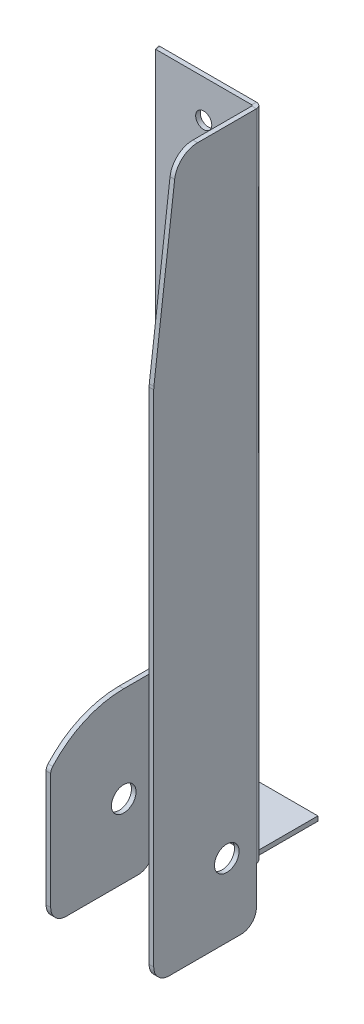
ISO-10303-21;
HEADER;
FILE_DESCRIPTION(('STEP AP214'),'2;1');
FILE_NAME('part.step','',(''),(''),'','','');
FILE_SCHEMA(('AUTOMOTIVE_DESIGN { 1 0 10303 214 1 1 1 1 }'));
ENDSEC;
DATA;
#1=APPLICATION_CONTEXT('core data for automotive mechanical design processes');
#2=APPLICATION_PROTOCOL_DEFINITION('international standard','automotive_design',2000,#1);
#3=PRODUCT_CONTEXT('',#1,'mechanical');
#4=PRODUCT('Part','Part','',(#3));
#5=PRODUCT_RELATED_PRODUCT_CATEGORY('part','',(#4));
#6=PRODUCT_DEFINITION_FORMATION('','',#4);
#7=PRODUCT_DEFINITION_CONTEXT('part definition',#1,'design');
#8=PRODUCT_DEFINITION('design','',#6,#7);
#9=PRODUCT_DEFINITION_SHAPE('','',#8);
#10=(LENGTH_UNIT() NAMED_UNIT(*) SI_UNIT(.MILLI.,.METRE.));
#11=(NAMED_UNIT(*) PLANE_ANGLE_UNIT() SI_UNIT($,.RADIAN.));
#12=(NAMED_UNIT(*) SI_UNIT($,.STERADIAN.) SOLID_ANGLE_UNIT());
#13=UNCERTAINTY_MEASURE_WITH_UNIT(LENGTH_MEASURE(1.E-05),#10,'distance_accuracy_value','');
#14=(GEOMETRIC_REPRESENTATION_CONTEXT(3) GLOBAL_UNCERTAINTY_ASSIGNED_CONTEXT((#13)) GLOBAL_UNIT_ASSIGNED_CONTEXT((#10,
#11,#12)) REPRESENTATION_CONTEXT('',''));
#15=CARTESIAN_POINT('',(0.,0.,0.));
#16=DIRECTION('',(0.,0.,1.));
#17=DIRECTION('',(1.,0.,0.));
#18=AXIS2_PLACEMENT_3D('',#15,#16,#17);
#19=CARTESIAN_POINT('',(35.0000000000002,425.,70.5));
#20=DIRECTION('',(0.,-1.,0.));
#21=DIRECTION('',(1.,0.,0.));
#22=AXIS2_PLACEMENT_3D('',#19,#20,#21);
#23=PLANE('',#22);
#24=DIRECTION('',(0.,0.,1.));
#25=VECTOR('',#24,1.);
#26=CARTESIAN_POINT('',(32.0000000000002,425.,70.5));
#27=LINE('',#26,#25);
#28=CARTESIAN_POINT('',(32.0000000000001,425.,3.73660000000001));
#29=VERTEX_POINT('',#28);
#30=CARTESIAN_POINT('',(32.0000000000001,425.,42.0038354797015));
#31=VERTEX_POINT('',#30);
#32=EDGE_CURVE('E336',#29,#31,#27,.T.);
#33=ORIENTED_EDGE('',*,*,#32,.T.);
#34=DIRECTION('',(-1.,0.,0.));
#35=VECTOR('',#34,1.);
#36=CARTESIAN_POINT('',(35.0000000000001,425.,42.0038354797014));
#37=LINE('',#36,#35);
#38=CARTESIAN_POINT('',(35.0000000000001,425.,42.0038354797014));
#39=VERTEX_POINT('',#38);
#40=EDGE_CURVE('E442',#31,#39,#37,.F.);
#41=ORIENTED_EDGE('',*,*,#40,.T.);
#42=DIRECTION('',(0.,0.,1.));
#43=VECTOR('',#42,1.);
#44=CARTESIAN_POINT('',(35.0000000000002,425.,70.5));
#45=LINE('',#44,#43);
#46=CARTESIAN_POINT('',(35.,425.,3.73660000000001));
#47=VERTEX_POINT('',#46);
#48=EDGE_CURVE('E341',#47,#39,#45,.T.);
#49=ORIENTED_EDGE('',*,*,#48,.F.);
#50=DIRECTION('',(1.,0.,0.));
#51=VECTOR('',#50,1.);
#52=CARTESIAN_POINT('',(32.,425.,3.73660000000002));
#53=LINE('',#52,#51);
#54=EDGE_CURVE('E328',#29,#47,#53,.T.);
#55=ORIENTED_EDGE('',*,*,#54,.F.);
#56=EDGE_LOOP('',(#33,#41,#49,#55));
#57=FACE_BOUND('',#56,.T.);
#58=ADVANCED_FACE('F52',(#57),#23,.F.);
#59=CARTESIAN_POINT('',(35.0000000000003,0.,70.5));
#60=DIRECTION('',(-1.,0.,0.));
#61=DIRECTION('',(0.,0.,1.));
#62=AXIS2_PLACEMENT_3D('',#59,#60,#61);
#63=PLANE('',#62);
#64=CARTESIAN_POINT('',(35.0000000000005,12.5,23.0000000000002));
#65=DIRECTION('',(-1.,0.,0.));
#66=DIRECTION('',(0.,0.,1.));
#67=AXIS2_PLACEMENT_3D('',#64,#65,#66);
#68=CIRCLE('',#67,8.);
#69=CARTESIAN_POINT('',(35.0000000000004,12.5,31.0000000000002));
#70=VERTEX_POINT('',#69);
#71=EDGE_CURVE('E388',#70,#70,#68,.T.);
#72=ORIENTED_EDGE('',*,*,#71,.T.);
#73=EDGE_LOOP('',(#72));
#74=FACE_BOUND('',#73,.T.);
#75=DIRECTION('',(0.,0.992546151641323,-0.121869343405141));
#76=VECTOR('',#75,1.);
#77=CARTESIAN_POINT('',(35.0000000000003,301.,70.5));
#78=LINE('',#77,#76);
#79=CARTESIAN_POINT('',(35.0000000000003,301.91060084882,70.3881922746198));
#80=VERTEX_POINT('',#79);
#81=CARTESIAN_POINT('',(35.0000000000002,411.828040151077,56.8920277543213));
#82=VERTEX_POINT('',#81);
#83=EDGE_CURVE('E734',#80,#82,#78,.T.);
#84=ORIENTED_EDGE('',*,*,#83,.F.);
#85=CARTESIAN_POINT('',(35.0000000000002,300.082560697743,55.5));
#86=DIRECTION('',(-1.,0.,0.));
#87=DIRECTION('',(0.,0.,1.));
#88=AXIS2_PLACEMENT_3D('',#85,#86,#87);
#89=CIRCLE('',#88,15.);
#90=CARTESIAN_POINT('',(35.0000000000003,300.082560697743,70.5));
#91=VERTEX_POINT('',#90);
#92=EDGE_CURVE('E440',#80,#91,#89,.F.);
#93=ORIENTED_EDGE('',*,*,#92,.T.);
#94=DIRECTION('',(0.,-1.,0.));
#95=VECTOR('',#94,1.);
#96=CARTESIAN_POINT('',(35.0000000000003,0.,70.5));
#97=LINE('',#96,#95);
#98=CARTESIAN_POINT('',(35.0000000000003,-25.,70.5));
#99=VERTEX_POINT('',#98);
#100=EDGE_CURVE('E344',#91,#99,#97,.T.);
#101=ORIENTED_EDGE('',*,*,#100,.T.);
#102=CARTESIAN_POINT('',(35.0000000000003,-25.,60.5));
#103=DIRECTION('',(-1.,0.,0.));
#104=DIRECTION('',(0.,0.,1.));
#105=AXIS2_PLACEMENT_3D('',#102,#103,#104);
#106=CIRCLE('',#105,10.);
#107=CARTESIAN_POINT('',(35.0000000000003,-35.,60.5));
#108=VERTEX_POINT('',#107);
#109=EDGE_CURVE('E410',#99,#108,#106,.F.);
#110=ORIENTED_EDGE('',*,*,#109,.T.);
#111=DIRECTION('',(0.,0.,1.));
#112=VECTOR('',#111,1.);
#113=CARTESIAN_POINT('',(35.0000000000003,-35.,3.73660000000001));
#114=LINE('',#113,#112);
#115=CARTESIAN_POINT('',(35.0000000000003,-35.,13.7366));
#116=VERTEX_POINT('',#115);
#117=EDGE_CURVE('E745',#116,#108,#114,.T.);
#118=ORIENTED_EDGE('',*,*,#117,.F.);
#119=CARTESIAN_POINT('',(35.0000000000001,-25.,13.7366));
#120=DIRECTION('',(-1.,0.,0.));
#121=DIRECTION('',(0.,0.,1.));
#122=AXIS2_PLACEMENT_3D('',#119,#120,#121);
#123=CIRCLE('',#122,10.);
#124=CARTESIAN_POINT('',(35.0000000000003,-25.,3.73660000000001));
#125=VERTEX_POINT('',#124);
#126=EDGE_CURVE('E412',#116,#125,#123,.F.);
#127=ORIENTED_EDGE('',*,*,#126,.T.);
#128=DIRECTION('',(0.,1.,0.));
#129=VECTOR('',#128,1.);
#130=CARTESIAN_POINT('',(35.0000000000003,-35.,3.73660000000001));
#131=LINE('',#130,#129);
#132=CARTESIAN_POINT('',(35.0000000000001,0.,3.7366));
#133=VERTEX_POINT('',#132);
#134=EDGE_CURVE('E748',#125,#133,#131,.T.);
#135=ORIENTED_EDGE('',*,*,#134,.T.);
#136=DIRECTION('',(0.,-1.,0.));
#137=VECTOR('',#136,1.);
#138=CARTESIAN_POINT('',(35.0000000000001,0.,3.73659999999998));
#139=LINE('',#138,#137);
#140=EDGE_CURVE('E331',#47,#133,#139,.T.);
#141=ORIENTED_EDGE('',*,*,#140,.F.);
#142=ORIENTED_EDGE('',*,*,#48,.T.);
#143=CARTESIAN_POINT('',(35.0000000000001,410.,42.0038354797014));
#144=DIRECTION('',(-1.,0.,0.));
#145=DIRECTION('',(0.,0.,1.));
#146=AXIS2_PLACEMENT_3D('',#143,#144,#145);
#147=CIRCLE('',#146,15.);
#148=EDGE_CURVE('E438',#39,#82,#147,.F.);
#149=ORIENTED_EDGE('',*,*,#148,.T.);
#150=EDGE_LOOP('',(#84,#93,#101,#110,#118,#127,#135,#141,#142,#149));
#151=FACE_BOUND('',#150,.T.);
#152=ADVANCED_FACE('F582',(#74,#151),#63,.F.);
#153=CARTESIAN_POINT('',(32.0000000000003,0.,70.5));
#154=DIRECTION('',(-1.,0.,0.));
#155=DIRECTION('',(0.,0.,1.));
#156=AXIS2_PLACEMENT_3D('',#153,#154,#155);
#157=PLANE('',#156);
#158=CARTESIAN_POINT('',(32.0000000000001,12.5,23.0000000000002));
#159=DIRECTION('',(-1.,0.,0.));
#160=DIRECTION('',(0.,0.,1.));
#161=AXIS2_PLACEMENT_3D('',#158,#159,#160);
#162=CIRCLE('',#161,8.);
#163=CARTESIAN_POINT('',(32.0000000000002,12.5,31.0000000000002));
#164=VERTEX_POINT('',#163);
#165=EDGE_CURVE('E387',#164,#164,#162,.T.);
#166=ORIENTED_EDGE('',*,*,#165,.F.);
#167=EDGE_LOOP('',(#166));
#168=FACE_BOUND('',#167,.T.);
#169=DIRECTION('',(0.,-1.,0.));
#170=VECTOR('',#169,1.);
#171=CARTESIAN_POINT('',(32.0000000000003,0.,70.5));
#172=LINE('',#171,#170);
#173=CARTESIAN_POINT('',(32.0000000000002,300.082560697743,70.5));
#174=VERTEX_POINT('',#173);
#175=CARTESIAN_POINT('',(32.0000000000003,-25.,70.5));
#176=VERTEX_POINT('',#175);
#177=EDGE_CURVE('E339',#174,#176,#172,.T.);
#178=ORIENTED_EDGE('',*,*,#177,.F.);
#179=CARTESIAN_POINT('',(32.0000000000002,300.082560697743,55.5));
#180=DIRECTION('',(-1.,0.,0.));
#181=DIRECTION('',(0.,0.,1.));
#182=AXIS2_PLACEMENT_3D('',#179,#180,#181);
#183=CIRCLE('',#182,15.);
#184=CARTESIAN_POINT('',(32.0000000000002,301.91060084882,70.3881922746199));
#185=VERTEX_POINT('',#184);
#186=EDGE_CURVE('E431',#174,#185,#183,.T.);
#187=ORIENTED_EDGE('',*,*,#186,.T.);
#188=DIRECTION('',(0.,0.992546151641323,-0.121869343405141));
#189=VECTOR('',#188,1.);
#190=CARTESIAN_POINT('',(32.0000000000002,301.,70.5));
#191=LINE('',#190,#189);
#192=CARTESIAN_POINT('',(32.0000000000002,411.828040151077,56.8920277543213));
#193=VERTEX_POINT('',#192);
#194=EDGE_CURVE('E736',#185,#193,#191,.T.);
#195=ORIENTED_EDGE('',*,*,#194,.T.);
#196=CARTESIAN_POINT('',(32.0000000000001,410.,42.0038354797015));
#197=DIRECTION('',(-1.,0.,0.));
#198=DIRECTION('',(0.,0.,1.));
#199=AXIS2_PLACEMENT_3D('',#196,#197,#198);
#200=CIRCLE('',#199,15.);
#201=EDGE_CURVE('E429',#193,#31,#200,.T.);
#202=ORIENTED_EDGE('',*,*,#201,.T.);
#203=ORIENTED_EDGE('',*,*,#32,.F.);
#204=DIRECTION('',(0.,1.,0.));
#205=VECTOR('',#204,1.);
#206=CARTESIAN_POINT('',(32.0000000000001,0.,3.7366));
#207=LINE('',#206,#205);
#208=CARTESIAN_POINT('',(32.0000000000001,0.,3.73660000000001));
#209=VERTEX_POINT('',#208);
#210=EDGE_CURVE('E326',#209,#29,#207,.T.);
#211=ORIENTED_EDGE('',*,*,#210,.F.);
#212=DIRECTION('',(0.,1.,0.));
#213=VECTOR('',#212,1.);
#214=CARTESIAN_POINT('',(32.,-35.,3.73660000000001));
#215=LINE('',#214,#213);
#216=CARTESIAN_POINT('',(32.,-25.,3.73660000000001));
#217=VERTEX_POINT('',#216);
#218=EDGE_CURVE('E750',#217,#209,#215,.T.);
#219=ORIENTED_EDGE('',*,*,#218,.F.);
#220=CARTESIAN_POINT('',(32.0000000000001,-25.,13.7366));
#221=DIRECTION('',(-1.,0.,0.));
#222=DIRECTION('',(0.,0.,1.));
#223=AXIS2_PLACEMENT_3D('',#220,#221,#222);
#224=CIRCLE('',#223,10.);
#225=CARTESIAN_POINT('',(32.,-35.,13.7366));
#226=VERTEX_POINT('',#225);
#227=EDGE_CURVE('E419',#217,#226,#224,.T.);
#228=ORIENTED_EDGE('',*,*,#227,.T.);
#229=DIRECTION('',(0.,0.,-1.));
#230=VECTOR('',#229,1.);
#231=CARTESIAN_POINT('',(32.,-35.,3.73660000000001));
#232=LINE('',#231,#230);
#233=CARTESIAN_POINT('',(32.,-35.,60.5));
#234=VERTEX_POINT('',#233);
#235=EDGE_CURVE('E740',#234,#226,#232,.T.);
#236=ORIENTED_EDGE('',*,*,#235,.F.);
#237=CARTESIAN_POINT('',(32.0000000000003,-25.,60.5));
#238=DIRECTION('',(-1.,0.,0.));
#239=DIRECTION('',(0.,0.,1.));
#240=AXIS2_PLACEMENT_3D('',#237,#238,#239);
#241=CIRCLE('',#240,10.);
#242=EDGE_CURVE('E416',#234,#176,#241,.T.);
#243=ORIENTED_EDGE('',*,*,#242,.T.);
#244=EDGE_LOOP('',(#178,#187,#195,#202,#203,#211,#219,#228,#236,#243));
#245=FACE_BOUND('',#244,.T.);
#246=ADVANCED_FACE('F588',(#168,#245),#157,.T.);
#247=CARTESIAN_POINT('',(35.0000000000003,0.,70.5));
#248=DIRECTION('',(0.,0.,-1.));
#249=DIRECTION('',(-1.,0.,0.));
#250=AXIS2_PLACEMENT_3D('',#247,#248,#249);
#251=PLANE('',#250);
#252=ORIENTED_EDGE('',*,*,#100,.F.);
#253=DIRECTION('',(-1.,0.,0.));
#254=VECTOR('',#253,1.);
#255=CARTESIAN_POINT('',(32.0000000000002,300.082560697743,70.5));
#256=LINE('',#255,#254);
#257=EDGE_CURVE('E426',#91,#174,#256,.T.);
#258=ORIENTED_EDGE('',*,*,#257,.T.);
#259=ORIENTED_EDGE('',*,*,#177,.T.);
#260=DIRECTION('',(-1.,0.,0.));
#261=VECTOR('',#260,1.);
#262=CARTESIAN_POINT('',(35.0000000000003,-25.,70.5));
#263=LINE('',#262,#261);
#264=EDGE_CURVE('E421',#176,#99,#263,.F.);
#265=ORIENTED_EDGE('',*,*,#264,.T.);
#266=EDGE_LOOP('',(#252,#258,#259,#265));
#267=FACE_BOUND('',#266,.T.);
#268=ADVANCED_FACE('F593',(#267),#251,.F.);
#269=CARTESIAN_POINT('',(-31.2634,425.,3.7366));
#270=DIRECTION('',(0.,1.,0.));
#271=DIRECTION('',(0.,0.,1.));
#272=AXIS2_PLACEMENT_3D('',#269,#270,#271);
#273=PLANE('',#272);
#274=CARTESIAN_POINT('',(-31.2634,425.,3.7366));
#275=DIRECTION('',(0.,-1.,0.));
#276=DIRECTION('',(0.,0.,-1.));
#277=AXIS2_PLACEMENT_3D('',#274,#275,#276);
#278=CIRCLE('',#277,3.73659999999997);
#279=CARTESIAN_POINT('',(-31.2634000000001,425.,0.));
#280=VERTEX_POINT('',#279);
#281=CARTESIAN_POINT('',(-32.,425.,0.0733227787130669));
#282=VERTEX_POINT('',#281);
#283=EDGE_CURVE('E316',#280,#282,#278,.F.);
#284=ORIENTED_EDGE('',*,*,#283,.T.);
#285=DIRECTION('',(-0.197131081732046,0.,-0.980377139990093));
#286=VECTOR('',#285,1.);
#287=CARTESIAN_POINT('',(-32.,425.,0.0733227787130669));
#288=LINE('',#287,#286);
#289=CARTESIAN_POINT('',(-31.4086067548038,425.,3.01445419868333));
#290=VERTEX_POINT('',#289);
#291=EDGE_CURVE('E551',#282,#290,#288,.F.);
#292=ORIENTED_EDGE('',*,*,#291,.T.);
#293=CARTESIAN_POINT('',(-31.2634,425.,3.7366));
#294=DIRECTION('',(0.,-1.,0.));
#295=DIRECTION('',(0.,0.,-1.));
#296=AXIS2_PLACEMENT_3D('',#293,#294,#295);
#297=CIRCLE('',#296,0.736599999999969);
#298=CARTESIAN_POINT('',(-31.2634000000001,425.,3.));
#299=VERTEX_POINT('',#298);
#300=EDGE_CURVE('E289',#299,#290,#297,.F.);
#301=ORIENTED_EDGE('',*,*,#300,.F.);
#302=DIRECTION('',(0.,0.,-1.));
#303=VECTOR('',#302,1.);
#304=CARTESIAN_POINT('',(-31.2634000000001,425.,3.00000000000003));
#305=LINE('',#304,#303);
#306=EDGE_CURVE('E321',#299,#280,#305,.T.);
#307=ORIENTED_EDGE('',*,*,#306,.T.);
#308=EDGE_LOOP('',(#284,#292,#301,#307));
#309=FACE_BOUND('',#308,.T.);
#310=ADVANCED_FACE('F564',(#309),#273,.T.);
#311=CARTESIAN_POINT('',(-31.2634,0.,3.7366));
#312=DIRECTION('',(0.,-1.,0.));
#313=DIRECTION('',(-1.,0.,0.));
#314=AXIS2_PLACEMENT_3D('',#311,#312,#313);
#315=CYLINDRICAL_SURFACE('',#314,3.73659999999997);
#316=CARTESIAN_POINT('',(-31.2634,74.5,3.7366));
#317=DIRECTION('',(0.,-1.,0.));
#318=DIRECTION('',(1.,0.,0.));
#319=AXIS2_PLACEMENT_3D('',#316,#317,#318);
#320=CIRCLE('',#319,3.73659999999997);
#321=CARTESIAN_POINT('',(-32.,74.5,0.0733227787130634));
#322=VERTEX_POINT('',#321);
#323=CARTESIAN_POINT('',(-35.,74.5,3.73659999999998));
#324=VERTEX_POINT('',#323);
#325=EDGE_CURVE('E545',#322,#324,#320,.F.);
#326=ORIENTED_EDGE('',*,*,#325,.F.);
#327=DIRECTION('',(0.,-1.,0.));
#328=VECTOR('',#327,1.);
#329=CARTESIAN_POINT('',(-32.,0.,0.0733227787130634));
#330=LINE('',#329,#328);
#331=EDGE_CURVE('E273',#282,#322,#330,.T.);
#332=ORIENTED_EDGE('',*,*,#331,.F.);
#333=ORIENTED_EDGE('',*,*,#283,.F.);
#334=DIRECTION('',(0.,-1.,0.));
#335=VECTOR('',#334,1.);
#336=CARTESIAN_POINT('',(-31.2634000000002,0.,0.));
#337=LINE('',#336,#335);
#338=CARTESIAN_POINT('',(-31.2634000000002,3.7366,0.));
#339=VERTEX_POINT('',#338);
#340=EDGE_CURVE('E288',#339,#280,#337,.F.);
#341=ORIENTED_EDGE('',*,*,#340,.F.);
#342=CARTESIAN_POINT('',(-31.2634000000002,0.0733227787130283,0.));
#343=VERTEX_POINT('',#342);
#344=EDGE_CURVE('E317',#343,#339,#337,.F.);
#345=ORIENTED_EDGE('',*,*,#344,.F.);
#346=CARTESIAN_POINT('',(-31.2634000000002,0.,0.));
#347=VERTEX_POINT('',#346);
#348=EDGE_CURVE('E285',#347,#343,#337,.F.);
#349=ORIENTED_EDGE('',*,*,#348,.F.);
#350=CARTESIAN_POINT('',(-31.2634,0.,3.7366));
#351=DIRECTION('',(0.,-1.,0.));
#352=DIRECTION('',(0.,0.,-1.));
#353=AXIS2_PLACEMENT_3D('',#350,#351,#352);
#354=CIRCLE('',#353,3.73659999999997);
#355=CARTESIAN_POINT('',(-35.,0.,3.73659999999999));
#356=VERTEX_POINT('',#355);
#357=EDGE_CURVE('E280',#356,#347,#354,.T.);
#358=ORIENTED_EDGE('',*,*,#357,.F.);
#359=DIRECTION('',(0.,1.,0.));
#360=VECTOR('',#359,1.);
#361=CARTESIAN_POINT('',(-35.,425.,3.73659999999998));
#362=LINE('',#361,#360);
#363=EDGE_CURVE('E283',#356,#324,#362,.T.);
#364=ORIENTED_EDGE('',*,*,#363,.T.);
#365=EDGE_LOOP('',(#326,#332,#333,#341,#345,#349,#358,#364));
#366=FACE_BOUND('',#365,.T.);
#367=ADVANCED_FACE('F282',(#366),#315,.T.);
#368=CARTESIAN_POINT('',(-31.2634,0.,3.7366));
#369=DIRECTION('',(0.,-1.,0.));
#370=DIRECTION('',(-1.,0.,0.));
#371=AXIS2_PLACEMENT_3D('',#368,#369,#370);
#372=CYLINDRICAL_SURFACE('',#371,0.736599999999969);
#373=DIRECTION('',(0.,-1.,0.));
#374=VECTOR('',#373,1.);
#375=CARTESIAN_POINT('',(-31.4086067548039,0.,3.01445419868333));
#376=LINE('',#375,#374);
#377=CARTESIAN_POINT('',(-31.4086067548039,74.5,3.01445419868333));
#378=VERTEX_POINT('',#377);
#379=EDGE_CURVE('E547',#290,#378,#376,.T.);
#380=ORIENTED_EDGE('',*,*,#379,.T.);
#381=CARTESIAN_POINT('',(-31.2634,74.5,3.7366));
#382=DIRECTION('',(0.,-1.,0.));
#383=DIRECTION('',(0.,0.,-1.));
#384=AXIS2_PLACEMENT_3D('',#381,#382,#383);
#385=CIRCLE('',#384,0.736599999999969);
#386=CARTESIAN_POINT('',(-32.,74.5,3.73659999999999));
#387=VERTEX_POINT('',#386);
#388=EDGE_CURVE('E535',#378,#387,#385,.F.);
#389=ORIENTED_EDGE('',*,*,#388,.T.);
#390=DIRECTION('',(0.,-1.,0.));
#391=VECTOR('',#390,1.);
#392=CARTESIAN_POINT('',(-32.,425.,3.7366));
#393=LINE('',#392,#391);
#394=CARTESIAN_POINT('',(-32.0000000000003,0.,3.73659999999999));
#395=VERTEX_POINT('',#394);
#396=EDGE_CURVE('E295',#387,#395,#393,.T.);
#397=ORIENTED_EDGE('',*,*,#396,.T.);
#398=CARTESIAN_POINT('',(-31.2634,0.,3.7366));
#399=DIRECTION('',(0.,-1.,0.));
#400=DIRECTION('',(0.,0.,-1.));
#401=AXIS2_PLACEMENT_3D('',#398,#399,#400);
#402=CIRCLE('',#401,0.736599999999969);
#403=CARTESIAN_POINT('',(-31.2634000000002,0.,3.00000000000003));
#404=VERTEX_POINT('',#403);
#405=EDGE_CURVE('E294',#395,#404,#402,.T.);
#406=ORIENTED_EDGE('',*,*,#405,.T.);
#407=DIRECTION('',(0.,-1.,0.));
#408=VECTOR('',#407,1.);
#409=CARTESIAN_POINT('',(-31.2634000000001,0.,3.00000000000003));
#410=LINE('',#409,#408);
#411=CARTESIAN_POINT('',(-31.2634000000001,3.7366,3.00000000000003));
#412=VERTEX_POINT('',#411);
#413=EDGE_CURVE('E310',#404,#412,#410,.F.);
#414=ORIENTED_EDGE('',*,*,#413,.T.);
#415=EDGE_CURVE('E313',#412,#299,#410,.F.);
#416=ORIENTED_EDGE('',*,*,#415,.T.);
#417=ORIENTED_EDGE('',*,*,#300,.T.);
#418=EDGE_LOOP('',(#380,#389,#397,#406,#414,#416,#417));
#419=FACE_BOUND('',#418,.T.);
#420=ADVANCED_FACE('F534',(#419),#372,.F.);
#421=CARTESIAN_POINT('',(-35.0000000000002,425.,70.5));
#422=DIRECTION('',(1.,0.,0.));
#423=DIRECTION('',(0.,0.,-1.));
#424=AXIS2_PLACEMENT_3D('',#421,#422,#423);
#425=PLANE('',#424);
#426=CARTESIAN_POINT('',(-35.0000000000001,12.5,23.));
#427=DIRECTION('',(-1.,0.,0.));
#428=DIRECTION('',(0.,0.,1.));
#429=AXIS2_PLACEMENT_3D('',#426,#427,#428);
#430=CIRCLE('',#429,8.);
#431=CARTESIAN_POINT('',(-35.0000000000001,12.5,31.));
#432=VERTEX_POINT('',#431);
#433=EDGE_CURVE('E471',#432,#432,#430,.T.);
#434=ORIENTED_EDGE('',*,*,#433,.F.);
#435=EDGE_LOOP('',(#434));
#436=FACE_BOUND('',#435,.T.);
#437=DIRECTION('',(0.,1.,0.));
#438=VECTOR('',#437,1.);
#439=CARTESIAN_POINT('',(-35.0000000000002,425.,70.5));
#440=LINE('',#439,#438);
#441=CARTESIAN_POINT('',(-35.0000000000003,-25.,70.5));
#442=VERTEX_POINT('',#441);
#443=CARTESIAN_POINT('',(-35.0000000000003,50.4835490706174,70.5));
#444=VERTEX_POINT('',#443);
#445=EDGE_CURVE('E303',#442,#444,#440,.T.);
#446=ORIENTED_EDGE('',*,*,#445,.T.);
#447=CARTESIAN_POINT('',(-35.0000000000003,50.4835490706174,65.5));
#448=DIRECTION('',(1.,0.,0.));
#449=DIRECTION('',(0.,0.,-1.));
#450=AXIS2_PLACEMENT_3D('',#447,#448,#449);
#451=CIRCLE('',#450,5.);
#452=CARTESIAN_POINT('',(-35.0000000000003,53.8154393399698,69.2280701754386));
#453=VERTEX_POINT('',#452);
#454=EDGE_CURVE('E13',#444,#453,#451,.F.);
#455=ORIENTED_EDGE('',*,*,#454,.T.);
#456=CARTESIAN_POINT('',(-35.0000000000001,12.5,23.));
#457=DIRECTION('',(1.,0.,0.));
#458=DIRECTION('',(0.,0.,-1.));
#459=AXIS2_PLACEMENT_3D('',#456,#457,#458);
#460=CIRCLE('',#459,62.);
#461=CARTESIAN_POINT('',(-35.0000000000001,74.5,23.));
#462=VERTEX_POINT('',#461);
#463=EDGE_CURVE('E454',#462,#453,#460,.T.);
#464=ORIENTED_EDGE('',*,*,#463,.F.);
#465=DIRECTION('',(0.,0.,1.));
#466=VECTOR('',#465,1.);
#467=CARTESIAN_POINT('',(-35.,74.5,0.));
#468=LINE('',#467,#466);
#469=EDGE_CURVE('E300',#324,#462,#468,.T.);
#470=ORIENTED_EDGE('',*,*,#469,.F.);
#471=ORIENTED_EDGE('',*,*,#363,.F.);
#472=DIRECTION('',(0.,1.,0.));
#473=VECTOR('',#472,1.);
#474=CARTESIAN_POINT('',(-35.,-35.,3.73659999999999));
#475=LINE('',#474,#473);
#476=CARTESIAN_POINT('',(-35.,-25.,3.73659999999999));
#477=VERTEX_POINT('',#476);
#478=EDGE_CURVE('E261',#477,#356,#475,.T.);
#479=ORIENTED_EDGE('',*,*,#478,.F.);
#480=CARTESIAN_POINT('',(-35.0000000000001,-25.,13.7366));
#481=DIRECTION('',(1.,0.,0.));
#482=DIRECTION('',(0.,0.,-1.));
#483=AXIS2_PLACEMENT_3D('',#480,#481,#482);
#484=CIRCLE('',#483,10.);
#485=CARTESIAN_POINT('',(-35.,-35.,13.7366));
#486=VERTEX_POINT('',#485);
#487=EDGE_CURVE('E402',#477,#486,#484,.F.);
#488=ORIENTED_EDGE('',*,*,#487,.T.);
#489=DIRECTION('',(0.,0.,-1.));
#490=VECTOR('',#489,1.);
#491=CARTESIAN_POINT('',(-35.,-35.,3.73659999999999));
#492=LINE('',#491,#490);
#493=CARTESIAN_POINT('',(-35.,-35.,60.5));
#494=VERTEX_POINT('',#493);
#495=EDGE_CURVE('E540',#494,#486,#492,.T.);
#496=ORIENTED_EDGE('',*,*,#495,.F.);
#497=CARTESIAN_POINT('',(-35.0000000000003,-25.,60.5));
#498=DIRECTION('',(1.,0.,0.));
#499=DIRECTION('',(0.,0.,-1.));
#500=AXIS2_PLACEMENT_3D('',#497,#498,#499);
#501=CIRCLE('',#500,10.);
#502=EDGE_CURVE('E400',#494,#442,#501,.F.);
#503=ORIENTED_EDGE('',*,*,#502,.T.);
#504=EDGE_LOOP('',(#446,#455,#464,#470,#471,#479,#488,#496,#503));
#505=FACE_BOUND('',#504,.T.);
#506=ADVANCED_FACE('F298',(#436,#505),#425,.F.);
#507=CARTESIAN_POINT('',(-32.0000000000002,425.,70.5));
#508=DIRECTION('',(1.,0.,0.));
#509=DIRECTION('',(0.,0.,-1.));
#510=AXIS2_PLACEMENT_3D('',#507,#508,#509);
#511=PLANE('',#510);
#512=CARTESIAN_POINT('',(-32.0000000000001,12.5,23.));
#513=DIRECTION('',(1.,0.,0.));
#514=DIRECTION('',(0.,0.,-1.));
#515=AXIS2_PLACEMENT_3D('',#512,#513,#514);
#516=CIRCLE('',#515,8.);
#517=CARTESIAN_POINT('',(-32.0000000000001,12.5,15.));
#518=VERTEX_POINT('',#517);
#519=EDGE_CURVE('E384',#518,#518,#516,.T.);
#520=ORIENTED_EDGE('',*,*,#519,.F.);
#521=EDGE_LOOP('',(#520));
#522=FACE_BOUND('',#521,.T.);
#523=CARTESIAN_POINT('',(-32.0000000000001,12.5,23.));
#524=DIRECTION('',(1.,0.,0.));
#525=DIRECTION('',(0.,0.,-1.));
#526=AXIS2_PLACEMENT_3D('',#523,#524,#525);
#527=CIRCLE('',#526,62.);
#528=CARTESIAN_POINT('',(-32.0000000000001,74.5,23.));
#529=VERTEX_POINT('',#528);
#530=CARTESIAN_POINT('',(-32.0000000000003,53.8154393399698,69.2280701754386));
#531=VERTEX_POINT('',#530);
#532=EDGE_CURVE('E452',#529,#531,#527,.T.);
#533=ORIENTED_EDGE('',*,*,#532,.T.);
#534=CARTESIAN_POINT('',(-32.0000000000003,50.4835490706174,65.5));
#535=DIRECTION('',(1.,0.,0.));
#536=DIRECTION('',(0.,0.,-1.));
#537=AXIS2_PLACEMENT_3D('',#534,#535,#536);
#538=CIRCLE('',#537,5.);
#539=CARTESIAN_POINT('',(-32.0000000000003,50.4835490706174,70.5));
#540=VERTEX_POINT('',#539);
#541=EDGE_CURVE('E74',#531,#540,#538,.T.);
#542=ORIENTED_EDGE('',*,*,#541,.T.);
#543=DIRECTION('',(0.,1.,0.));
#544=VECTOR('',#543,1.);
#545=CARTESIAN_POINT('',(-32.0000000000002,425.,70.5));
#546=LINE('',#545,#544);
#547=CARTESIAN_POINT('',(-32.0000000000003,-25.,70.5));
#548=VERTEX_POINT('',#547);
#549=EDGE_CURVE('E301',#548,#540,#546,.T.);
#550=ORIENTED_EDGE('',*,*,#549,.F.);
#551=CARTESIAN_POINT('',(-32.0000000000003,-25.,60.5));
#552=DIRECTION('',(1.,0.,0.));
#553=DIRECTION('',(0.,0.,-1.));
#554=AXIS2_PLACEMENT_3D('',#551,#552,#553);
#555=CIRCLE('',#554,10.);
#556=CARTESIAN_POINT('',(-32.0000000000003,-35.,60.5));
#557=VERTEX_POINT('',#556);
#558=EDGE_CURVE('E395',#548,#557,#555,.T.);
#559=ORIENTED_EDGE('',*,*,#558,.T.);
#560=DIRECTION('',(0.,0.,1.));
#561=VECTOR('',#560,1.);
#562=CARTESIAN_POINT('',(-32.0000000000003,-35.,3.73659999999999));
#563=LINE('',#562,#561);
#564=CARTESIAN_POINT('',(-32.0000000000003,-35.,13.7366));
#565=VERTEX_POINT('',#564);
#566=EDGE_CURVE('E537',#565,#557,#563,.T.);
#567=ORIENTED_EDGE('',*,*,#566,.F.);
#568=CARTESIAN_POINT('',(-32.0000000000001,-25.,13.7366));
#569=DIRECTION('',(1.,0.,0.));
#570=DIRECTION('',(0.,0.,-1.));
#571=AXIS2_PLACEMENT_3D('',#568,#569,#570);
#572=CIRCLE('',#571,10.);
#573=CARTESIAN_POINT('',(-32.0000000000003,-25.,3.73659999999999));
#574=VERTEX_POINT('',#573);
#575=EDGE_CURVE('E397',#565,#574,#572,.T.);
#576=ORIENTED_EDGE('',*,*,#575,.T.);
#577=DIRECTION('',(0.,1.,0.));
#578=VECTOR('',#577,1.);
#579=CARTESIAN_POINT('',(-32.0000000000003,-35.,3.73659999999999));
#580=LINE('',#579,#578);
#581=EDGE_CURVE('E274',#574,#395,#580,.T.);
#582=ORIENTED_EDGE('',*,*,#581,.T.);
#583=ORIENTED_EDGE('',*,*,#396,.F.);
#584=DIRECTION('',(0.,0.,-1.));
#585=VECTOR('',#584,1.);
#586=CARTESIAN_POINT('',(-32.0000000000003,74.5,70.5));
#587=LINE('',#586,#585);
#588=EDGE_CURVE('E460',#387,#529,#587,.F.);
#589=ORIENTED_EDGE('',*,*,#588,.T.);
#590=EDGE_LOOP('',(#533,#542,#550,#559,#567,#576,#582,#583,#589));
#591=FACE_BOUND('',#590,.T.);
#592=ADVANCED_FACE('F458',(#522,#591),#511,.T.);
#593=CARTESIAN_POINT('',(-35.0000000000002,425.,70.5));
#594=DIRECTION('',(0.,0.,-1.));
#595=DIRECTION('',(-1.,0.,0.));
#596=AXIS2_PLACEMENT_3D('',#593,#594,#595);
#597=PLANE('',#596);
#598=ORIENTED_EDGE('',*,*,#549,.T.);
#599=DIRECTION('',(-1.,0.,0.));
#600=VECTOR('',#599,1.);
#601=CARTESIAN_POINT('',(-35.0000000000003,50.4835490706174,70.5));
#602=LINE('',#601,#600);
#603=EDGE_CURVE('E60',#540,#444,#602,.T.);
#604=ORIENTED_EDGE('',*,*,#603,.T.);
#605=ORIENTED_EDGE('',*,*,#445,.F.);
#606=DIRECTION('',(-1.,0.,0.));
#607=VECTOR('',#606,1.);
#608=CARTESIAN_POINT('',(-35.0000000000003,-25.,70.5));
#609=LINE('',#608,#607);
#610=EDGE_CURVE('E424',#442,#548,#609,.F.);
#611=ORIENTED_EDGE('',*,*,#610,.T.);
#612=EDGE_LOOP('',(#598,#604,#605,#611));
#613=FACE_BOUND('',#612,.T.);
#614=ADVANCED_FACE('F694',(#613),#597,.F.);
#615=CARTESIAN_POINT('',(-31.2634000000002,0.,0.));
#616=DIRECTION('',(1.,0.,0.));
#617=DIRECTION('',(0.,1.,0.));
#618=AXIS2_PLACEMENT_3D('',#615,#616,#617);
#619=PLANE('',#618);
#620=ORIENTED_EDGE('',*,*,#348,.T.);
#621=CARTESIAN_POINT('',(-31.2634000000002,3.7366,-0.736599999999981));
#622=DIRECTION('',(-1.,0.,0.));
#623=DIRECTION('',(0.,0.,1.));
#624=AXIS2_PLACEMENT_3D('',#621,#622,#623);
#625=CIRCLE('',#624,3.7366);
#626=EDGE_CURVE('E383',#343,#412,#625,.T.);
#627=ORIENTED_EDGE('',*,*,#626,.T.);
#628=ORIENTED_EDGE('',*,*,#413,.F.);
#629=DIRECTION('',(0.,0.,-1.));
#630=VECTOR('',#629,1.);
#631=CARTESIAN_POINT('',(-31.2634000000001,0.,3.00000000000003));
#632=LINE('',#631,#630);
#633=EDGE_CURVE('E319',#404,#347,#632,.T.);
#634=ORIENTED_EDGE('',*,*,#633,.T.);
#635=EDGE_LOOP('',(#620,#627,#628,#634));
#636=FACE_BOUND('',#635,.T.);
#637=ADVANCED_FACE('F624',(#636),#619,.T.);
#638=CARTESIAN_POINT('',(31.2634,3.7366,0.));
#639=DIRECTION('',(-1.,0.,0.));
#640=DIRECTION('',(0.,0.,1.));
#641=AXIS2_PLACEMENT_3D('',#638,#639,#640);
#642=PLANE('',#641);
#643=DIRECTION('',(0.,1.,0.));
#644=VECTOR('',#643,1.);
#645=CARTESIAN_POINT('',(31.2634,425.,2.99999999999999));
#646=LINE('',#645,#644);
#647=CARTESIAN_POINT('',(31.2634,3.7366,2.99999999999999));
#648=VERTEX_POINT('',#647);
#649=CARTESIAN_POINT('',(31.2634,0.,2.99999999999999));
#650=VERTEX_POINT('',#649);
#651=EDGE_CURVE('E354',#648,#650,#646,.F.);
#652=ORIENTED_EDGE('',*,*,#651,.F.);
#653=CARTESIAN_POINT('',(31.2634,3.7366,-0.736600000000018));
#654=DIRECTION('',(-1.,0.,0.));
#655=DIRECTION('',(0.,0.,1.));
#656=AXIS2_PLACEMENT_3D('',#653,#654,#655);
#657=CIRCLE('',#656,3.7366);
#658=CARTESIAN_POINT('',(31.2634,0.0733227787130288,0.));
#659=VERTEX_POINT('',#658);
#660=EDGE_CURVE('E523',#648,#659,#657,.F.);
#661=ORIENTED_EDGE('',*,*,#660,.T.);
#662=DIRECTION('',(0.,-1.,0.));
#663=VECTOR('',#662,1.);
#664=CARTESIAN_POINT('',(31.2634,3.7366,0.));
#665=LINE('',#664,#663);
#666=CARTESIAN_POINT('',(31.2634,0.,0.));
#667=VERTEX_POINT('',#666);
#668=EDGE_CURVE('E526',#659,#667,#665,.T.);
#669=ORIENTED_EDGE('',*,*,#668,.T.);
#670=DIRECTION('',(0.,0.,-1.));
#671=VECTOR('',#670,1.);
#672=CARTESIAN_POINT('',(31.2634,0.,2.99999999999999));
#673=LINE('',#672,#671);
#674=EDGE_CURVE('E366',#650,#667,#673,.T.);
#675=ORIENTED_EDGE('',*,*,#674,.F.);
#676=EDGE_LOOP('',(#652,#661,#669,#675));
#677=FACE_BOUND('',#676,.T.);
#678=ADVANCED_FACE('F619',(#677),#642,.T.);
#679=CARTESIAN_POINT('',(-32.0000000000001,0.,3.));
#680=DIRECTION('',(0.,0.,1.));
#681=DIRECTION('',(1.,0.,0.));
#682=AXIS2_PLACEMENT_3D('',#679,#680,#681);
#683=PLANE('',#682);
#684=CARTESIAN_POINT('',(0.,400.6,3.));
#685=DIRECTION('',(0.,0.,1.));
#686=DIRECTION('',(1.,0.,0.));
#687=AXIS2_PLACEMENT_3D('',#684,#685,#686);
#688=CIRCLE('',#687,5.25);
#689=CARTESIAN_POINT('',(5.25,400.6,3.));
#690=VERTEX_POINT('',#689);
#691=EDGE_CURVE('E374',#690,#690,#688,.T.);
#692=ORIENTED_EDGE('',*,*,#691,.F.);
#693=EDGE_LOOP('',(#692));
#694=FACE_BOUND('',#693,.T.);
#695=ORIENTED_EDGE('',*,*,#415,.F.);
#696=DIRECTION('',(-1.,0.,0.));
#697=VECTOR('',#696,1.);
#698=CARTESIAN_POINT('',(-31.2634000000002,3.7366,3.00000000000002));
#699=LINE('',#698,#697);
#700=EDGE_CURVE('E519',#412,#648,#699,.F.);
#701=ORIENTED_EDGE('',*,*,#700,.T.);
#702=CARTESIAN_POINT('',(31.2634,425.,2.99999999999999));
#703=VERTEX_POINT('',#702);
#704=EDGE_CURVE('E351',#703,#648,#646,.F.);
#705=ORIENTED_EDGE('',*,*,#704,.F.);
#706=DIRECTION('',(-1.,0.,0.));
#707=VECTOR('',#706,1.);
#708=CARTESIAN_POINT('',(-32.,425.,3.));
#709=LINE('',#708,#707);
#710=EDGE_CURVE('E380',#703,#299,#709,.T.);
#711=ORIENTED_EDGE('',*,*,#710,.T.);
#712=EDGE_LOOP('',(#695,#701,#705,#711));
#713=FACE_BOUND('',#712,.T.);
#714=ADVANCED_FACE('F616',(#694,#713),#683,.T.);
#715=CARTESIAN_POINT('',(-32.0000000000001,0.,0.));
#716=DIRECTION('',(0.,0.,1.));
#717=DIRECTION('',(1.,0.,0.));
#718=AXIS2_PLACEMENT_3D('',#715,#716,#717);
#719=PLANE('',#718);
#720=CARTESIAN_POINT('',(0.,400.6,0.));
#721=DIRECTION('',(0.,0.,1.));
#722=DIRECTION('',(1.,0.,0.));
#723=AXIS2_PLACEMENT_3D('',#720,#721,#722);
#724=CIRCLE('',#723,5.25);
#725=CARTESIAN_POINT('',(5.25,400.6,0.));
#726=VERTEX_POINT('',#725);
#727=EDGE_CURVE('E369',#726,#726,#724,.T.);
#728=ORIENTED_EDGE('',*,*,#727,.T.);
#729=EDGE_LOOP('',(#728));
#730=FACE_BOUND('',#729,.T.);
#731=DIRECTION('',(-1.,0.,0.));
#732=VECTOR('',#731,1.);
#733=CARTESIAN_POINT('',(-31.2634000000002,3.7366,0.));
#734=LINE('',#733,#732);
#735=CARTESIAN_POINT('',(31.2634,3.7366,0.));
#736=VERTEX_POINT('',#735);
#737=EDGE_CURVE('E514',#339,#736,#734,.F.);
#738=ORIENTED_EDGE('',*,*,#737,.F.);
#739=ORIENTED_EDGE('',*,*,#340,.T.);
#740=DIRECTION('',(-1.,0.,0.));
#741=VECTOR('',#740,1.);
#742=CARTESIAN_POINT('',(-32.,425.,0.));
#743=LINE('',#742,#741);
#744=CARTESIAN_POINT('',(31.2633999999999,425.,0.));
#745=VERTEX_POINT('',#744);
#746=EDGE_CURVE('E377',#745,#280,#743,.T.);
#747=ORIENTED_EDGE('',*,*,#746,.F.);
#748=DIRECTION('',(0.,1.,0.));
#749=VECTOR('',#748,1.);
#750=CARTESIAN_POINT('',(31.2633999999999,425.,0.));
#751=LINE('',#750,#749);
#752=EDGE_CURVE('E357',#745,#736,#751,.F.);
#753=ORIENTED_EDGE('',*,*,#752,.T.);
#754=EDGE_LOOP('',(#738,#739,#747,#753));
#755=FACE_BOUND('',#754,.T.);
#756=ADVANCED_FACE('F614',(#730,#755),#719,.F.);
#757=CARTESIAN_POINT('',(-32.,425.,3.));
#758=DIRECTION('',(0.,-1.,0.));
#759=DIRECTION('',(0.,0.,-1.));
#760=AXIS2_PLACEMENT_3D('',#757,#758,#759);
#761=PLANE('',#760);
#762=ORIENTED_EDGE('',*,*,#306,.F.);
#763=ORIENTED_EDGE('',*,*,#710,.F.);
#764=DIRECTION('',(0.,0.,-1.));
#765=VECTOR('',#764,1.);
#766=CARTESIAN_POINT('',(31.2634,425.,2.99999999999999));
#767=LINE('',#766,#765);
#768=EDGE_CURVE('E363',#703,#745,#767,.T.);
#769=ORIENTED_EDGE('',*,*,#768,.T.);
#770=ORIENTED_EDGE('',*,*,#746,.T.);
#771=EDGE_LOOP('',(#762,#763,#769,#770));
#772=FACE_BOUND('',#771,.T.);
#773=ADVANCED_FACE('F54',(#772),#761,.F.);
#774=CARTESIAN_POINT('',(0.,400.6,3.));
#775=DIRECTION('',(0.,0.,-1.));
#776=DIRECTION('',(-1.,0.,0.));
#777=AXIS2_PLACEMENT_3D('',#774,#775,#776);
#778=CYLINDRICAL_SURFACE('',#777,5.25);
#779=ORIENTED_EDGE('',*,*,#691,.T.);
#780=EDGE_LOOP('',(#779));
#781=FACE_BOUND('',#780,.T.);
#782=ORIENTED_EDGE('',*,*,#727,.F.);
#783=EDGE_LOOP('',(#782));
#784=FACE_BOUND('',#783,.T.);
#785=ADVANCED_FACE('F606',(#781,#784),#778,.F.);
#786=CARTESIAN_POINT('',(31.2634,0.,3.73660000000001));
#787=DIRECTION('',(0.,-1.,0.));
#788=DIRECTION('',(0.,0.,-1.));
#789=AXIS2_PLACEMENT_3D('',#786,#787,#788);
#790=PLANE('',#789);
#791=DIRECTION('',(1.,0.,0.));
#792=VECTOR('',#791,1.);
#793=CARTESIAN_POINT('',(32.0000000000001,0.,3.7366));
#794=LINE('',#793,#792);
#795=EDGE_CURVE('E324',#209,#133,#794,.T.);
#796=ORIENTED_EDGE('',*,*,#795,.F.);
#797=CARTESIAN_POINT('',(31.2634,0.,3.73660000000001));
#798=DIRECTION('',(0.,1.,0.));
#799=DIRECTION('',(0.,0.,1.));
#800=AXIS2_PLACEMENT_3D('',#797,#798,#799);
#801=CIRCLE('',#800,0.736600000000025);
#802=EDGE_CURVE('E347',#650,#209,#801,.F.);
#803=ORIENTED_EDGE('',*,*,#802,.F.);
#804=ORIENTED_EDGE('',*,*,#674,.T.);
#805=CARTESIAN_POINT('',(31.2634,0.,3.73660000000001));
#806=DIRECTION('',(0.,1.,0.));
#807=DIRECTION('',(0.,0.,1.));
#808=AXIS2_PLACEMENT_3D('',#805,#806,#807);
#809=CIRCLE('',#808,3.73660000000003);
#810=EDGE_CURVE('E360',#667,#133,#809,.F.);
#811=ORIENTED_EDGE('',*,*,#810,.T.);
#812=EDGE_LOOP('',(#796,#803,#804,#811));
#813=FACE_BOUND('',#812,.T.);
#814=ADVANCED_FACE('F603',(#813),#790,.T.);
#815=CARTESIAN_POINT('',(31.2634,425.,3.73660000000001));
#816=DIRECTION('',(0.,-1.,0.));
#817=DIRECTION('',(0.,0.,-1.));
#818=AXIS2_PLACEMENT_3D('',#815,#816,#817);
#819=PLANE('',#818);
#820=CARTESIAN_POINT('',(31.2634,425.,3.73660000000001));
#821=DIRECTION('',(0.,1.,0.));
#822=DIRECTION('',(0.,0.,1.));
#823=AXIS2_PLACEMENT_3D('',#820,#821,#822);
#824=CIRCLE('',#823,0.736600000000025);
#825=EDGE_CURVE('E346',#29,#703,#824,.T.);
#826=ORIENTED_EDGE('',*,*,#825,.F.);
#827=ORIENTED_EDGE('',*,*,#54,.T.);
#828=CARTESIAN_POINT('',(31.2634,425.,3.73660000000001));
#829=DIRECTION('',(0.,1.,0.));
#830=DIRECTION('',(0.,0.,1.));
#831=AXIS2_PLACEMENT_3D('',#828,#829,#830);
#832=CIRCLE('',#831,3.73660000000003);
#833=EDGE_CURVE('E350',#47,#745,#832,.T.);
#834=ORIENTED_EDGE('',*,*,#833,.T.);
#835=ORIENTED_EDGE('',*,*,#768,.F.);
#836=EDGE_LOOP('',(#826,#827,#834,#835));
#837=FACE_BOUND('',#836,.T.);
#838=ADVANCED_FACE('F599',(#837),#819,.F.);
#839=CARTESIAN_POINT('',(31.2634,425.,3.73660000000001));
#840=DIRECTION('',(0.,1.,0.));
#841=DIRECTION('',(1.,0.,0.));
#842=AXIS2_PLACEMENT_3D('',#839,#840,#841);
#843=CYLINDRICAL_SURFACE('',#842,3.73660000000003);
#844=ORIENTED_EDGE('',*,*,#752,.F.);
#845=ORIENTED_EDGE('',*,*,#833,.F.);
#846=ORIENTED_EDGE('',*,*,#140,.T.);
#847=ORIENTED_EDGE('',*,*,#810,.F.);
#848=ORIENTED_EDGE('',*,*,#668,.F.);
#849=EDGE_CURVE('E529',#736,#659,#665,.T.);
#850=ORIENTED_EDGE('',*,*,#849,.F.);
#851=EDGE_LOOP('',(#844,#845,#846,#847,#848,#850));
#852=FACE_BOUND('',#851,.T.);
#853=ADVANCED_FACE('F597',(#852),#843,.T.);
#854=CARTESIAN_POINT('',(31.2634,425.,3.73660000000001));
#855=DIRECTION('',(0.,1.,0.));
#856=DIRECTION('',(1.,0.,0.));
#857=AXIS2_PLACEMENT_3D('',#854,#855,#856);
#858=CYLINDRICAL_SURFACE('',#857,0.736600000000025);
#859=ORIENTED_EDGE('',*,*,#704,.T.);
#860=ORIENTED_EDGE('',*,*,#651,.T.);
#861=ORIENTED_EDGE('',*,*,#802,.T.);
#862=ORIENTED_EDGE('',*,*,#210,.T.);
#863=ORIENTED_EDGE('',*,*,#825,.T.);
#864=EDGE_LOOP('',(#859,#860,#861,#862,#863));
#865=FACE_BOUND('',#864,.T.);
#866=ADVANCED_FACE('F594',(#865),#858,.F.);
#867=CARTESIAN_POINT('',(-31.2634,0.,3.7366));
#868=DIRECTION('',(0.,1.,0.));
#869=DIRECTION('',(0.,0.,1.));
#870=AXIS2_PLACEMENT_3D('',#867,#868,#869);
#871=PLANE('',#870);
#872=ORIENTED_EDGE('',*,*,#405,.F.);
#873=DIRECTION('',(-1.,0.,0.));
#874=VECTOR('',#873,1.);
#875=CARTESIAN_POINT('',(-32.0000000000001,0.,3.7366));
#876=LINE('',#875,#874);
#877=EDGE_CURVE('E266',#395,#356,#876,.T.);
#878=ORIENTED_EDGE('',*,*,#877,.T.);
#879=ORIENTED_EDGE('',*,*,#357,.T.);
#880=ORIENTED_EDGE('',*,*,#633,.F.);
#881=EDGE_LOOP('',(#872,#878,#879,#880));
#882=FACE_BOUND('',#881,.T.);
#883=ADVANCED_FACE('F292',(#882),#871,.F.);
#884=CARTESIAN_POINT('',(31.2634,3.7366,-0.736600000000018));
#885=DIRECTION('',(1.,0.,0.));
#886=DIRECTION('',(0.,0.,-1.));
#887=AXIS2_PLACEMENT_3D('',#884,#885,#886);
#888=PLANE('',#887);
#889=CARTESIAN_POINT('',(31.2634,3.7366,-0.736600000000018));
#890=DIRECTION('',(-1.,0.,0.));
#891=DIRECTION('',(0.,0.,1.));
#892=AXIS2_PLACEMENT_3D('',#889,#890,#891);
#893=CIRCLE('',#892,0.7366);
#894=CARTESIAN_POINT('',(31.2634,3.,-0.736600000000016));
#895=VERTEX_POINT('',#894);
#896=EDGE_CURVE('E510',#736,#895,#893,.F.);
#897=ORIENTED_EDGE('',*,*,#896,.F.);
#898=ORIENTED_EDGE('',*,*,#849,.T.);
#899=CARTESIAN_POINT('',(31.2634,0.,-0.736600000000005));
#900=VERTEX_POINT('',#899);
#901=EDGE_CURVE('E522',#659,#900,#657,.F.);
#902=ORIENTED_EDGE('',*,*,#901,.T.);
#903=DIRECTION('',(0.,1.,0.));
#904=VECTOR('',#903,1.);
#905=CARTESIAN_POINT('',(31.2634,0.,-0.736600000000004));
#906=LINE('',#905,#904);
#907=EDGE_CURVE('E478',#895,#900,#906,.F.);
#908=ORIENTED_EDGE('',*,*,#907,.F.);
#909=EDGE_LOOP('',(#897,#898,#902,#908));
#910=FACE_BOUND('',#909,.T.);
#911=ADVANCED_FACE('F640',(#910),#888,.T.);
#912=CARTESIAN_POINT('',(-31.2634000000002,3.7366,-0.736599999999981));
#913=DIRECTION('',(1.,0.,0.));
#914=DIRECTION('',(0.,0.,-1.));
#915=AXIS2_PLACEMENT_3D('',#912,#913,#914);
#916=PLANE('',#915);
#917=CARTESIAN_POINT('',(-31.2634000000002,0.,-0.736599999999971));
#918=VERTEX_POINT('',#917);
#919=EDGE_CURVE('E513',#918,#343,#625,.T.);
#920=ORIENTED_EDGE('',*,*,#919,.T.);
#921=ORIENTED_EDGE('',*,*,#344,.T.);
#922=CARTESIAN_POINT('',(-31.2634000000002,3.7366,-0.736599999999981));
#923=DIRECTION('',(-1.,0.,0.));
#924=DIRECTION('',(0.,0.,1.));
#925=AXIS2_PLACEMENT_3D('',#922,#923,#924);
#926=CIRCLE('',#925,0.7366);
#927=CARTESIAN_POINT('',(-31.2634000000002,3.,-0.736599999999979));
#928=VERTEX_POINT('',#927);
#929=EDGE_CURVE('E482',#928,#339,#926,.T.);
#930=ORIENTED_EDGE('',*,*,#929,.F.);
#931=DIRECTION('',(0.,1.,0.));
#932=VECTOR('',#931,1.);
#933=CARTESIAN_POINT('',(-31.2634000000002,3.00000000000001,-0.736599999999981));
#934=LINE('',#933,#932);
#935=EDGE_CURVE('E503',#928,#918,#934,.F.);
#936=ORIENTED_EDGE('',*,*,#935,.T.);
#937=EDGE_LOOP('',(#920,#921,#930,#936));
#938=FACE_BOUND('',#937,.T.);
#939=ADVANCED_FACE('F651',(#938),#916,.F.);
#940=CARTESIAN_POINT('',(-31.2634000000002,3.7366,-0.736599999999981));
#941=DIRECTION('',(-1.,0.,0.));
#942=DIRECTION('',(0.,-1.,0.));
#943=AXIS2_PLACEMENT_3D('',#940,#941,#942);
#944=CYLINDRICAL_SURFACE('',#943,3.7366);
#945=ORIENTED_EDGE('',*,*,#700,.F.);
#946=ORIENTED_EDGE('',*,*,#626,.F.);
#947=ORIENTED_EDGE('',*,*,#919,.F.);
#948=DIRECTION('',(-1.,0.,0.));
#949=VECTOR('',#948,1.);
#950=CARTESIAN_POINT('',(31.2634,0.,-0.736600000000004));
#951=LINE('',#950,#949);
#952=EDGE_CURVE('E500',#918,#900,#951,.F.);
#953=ORIENTED_EDGE('',*,*,#952,.T.);
#954=ORIENTED_EDGE('',*,*,#901,.F.);
#955=ORIENTED_EDGE('',*,*,#660,.F.);
#956=EDGE_LOOP('',(#945,#946,#947,#953,#954,#955));
#957=FACE_BOUND('',#956,.T.);
#958=ADVANCED_FACE('F635',(#957),#944,.T.);
#959=CARTESIAN_POINT('',(-31.2634000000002,3.7366,-0.736599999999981));
#960=DIRECTION('',(-1.,0.,0.));
#961=DIRECTION('',(0.,-1.,0.));
#962=AXIS2_PLACEMENT_3D('',#959,#960,#961);
#963=CYLINDRICAL_SURFACE('',#962,0.7366);
#964=ORIENTED_EDGE('',*,*,#737,.T.);
#965=ORIENTED_EDGE('',*,*,#896,.T.);
#966=DIRECTION('',(-1.,0.,0.));
#967=VECTOR('',#966,1.);
#968=CARTESIAN_POINT('',(31.2634,3.,-0.736600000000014));
#969=LINE('',#968,#967);
#970=EDGE_CURVE('E506',#895,#928,#969,.T.);
#971=ORIENTED_EDGE('',*,*,#970,.T.);
#972=ORIENTED_EDGE('',*,*,#929,.T.);
#973=EDGE_LOOP('',(#964,#965,#971,#972));
#974=FACE_BOUND('',#973,.T.);
#975=ADVANCED_FACE('F645',(#974),#963,.F.);
#976=CARTESIAN_POINT('',(-31.2634000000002,-1.39645239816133E-13,-40.));
#977=DIRECTION('',(1.,0.,0.));
#978=DIRECTION('',(0.,0.,-1.));
#979=AXIS2_PLACEMENT_3D('',#976,#977,#978);
#980=PLANE('',#979);
#981=ORIENTED_EDGE('',*,*,#935,.F.);
#982=DIRECTION('',(0.,0.,1.));
#983=VECTOR('',#982,1.);
#984=CARTESIAN_POINT('',(-31.2634000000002,2.99999999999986,-40.));
#985=LINE('',#984,#983);
#986=CARTESIAN_POINT('',(-31.2634000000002,2.99999999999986,-40.));
#987=VERTEX_POINT('',#986);
#988=EDGE_CURVE('E498',#928,#987,#985,.F.);
#989=ORIENTED_EDGE('',*,*,#988,.T.);
#990=DIRECTION('',(0.,1.,0.));
#991=VECTOR('',#990,1.);
#992=CARTESIAN_POINT('',(-31.2634000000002,-1.39645239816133E-13,-40.));
#993=LINE('',#992,#991);
#994=CARTESIAN_POINT('',(-31.2634000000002,-1.39659334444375E-13,-40.));
#995=VERTEX_POINT('',#994);
#996=EDGE_CURVE('E479',#995,#987,#993,.T.);
#997=ORIENTED_EDGE('',*,*,#996,.F.);
#998=DIRECTION('',(0.,0.,-1.));
#999=VECTOR('',#998,1.);
#1000=CARTESIAN_POINT('',(-31.2634000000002,0.,0.));
#1001=LINE('',#1000,#999);
#1002=EDGE_CURVE('E491',#918,#995,#1001,.T.);
#1003=ORIENTED_EDGE('',*,*,#1002,.F.);
#1004=EDGE_LOOP('',(#981,#989,#997,#1003));
#1005=FACE_BOUND('',#1004,.T.);
#1006=ADVANCED_FACE('F656',(#1005),#980,.F.);
#1007=CARTESIAN_POINT('',(31.2634,0.,0.));
#1008=DIRECTION('',(-1.,0.,0.));
#1009=DIRECTION('',(0.,0.,1.));
#1010=AXIS2_PLACEMENT_3D('',#1007,#1008,#1009);
#1011=PLANE('',#1010);
#1012=ORIENTED_EDGE('',*,*,#907,.T.);
#1013=DIRECTION('',(0.,0.,1.));
#1014=VECTOR('',#1013,1.);
#1015=CARTESIAN_POINT('',(31.2634,0.,0.));
#1016=LINE('',#1015,#1014);
#1017=CARTESIAN_POINT('',(31.2634,-1.39659334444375E-13,-40.));
#1018=VERTEX_POINT('',#1017);
#1019=EDGE_CURVE('E486',#1018,#900,#1016,.T.);
#1020=ORIENTED_EDGE('',*,*,#1019,.F.);
#1021=DIRECTION('',(0.,1.,0.));
#1022=VECTOR('',#1021,1.);
#1023=CARTESIAN_POINT('',(31.2634,-1.39659334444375E-13,-40.));
#1024=LINE('',#1023,#1022);
#1025=CARTESIAN_POINT('',(31.2634,2.99999999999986,-40.));
#1026=VERTEX_POINT('',#1025);
#1027=EDGE_CURVE('E483',#1018,#1026,#1024,.T.);
#1028=ORIENTED_EDGE('',*,*,#1027,.T.);
#1029=DIRECTION('',(0.,0.,-1.));
#1030=VECTOR('',#1029,1.);
#1031=CARTESIAN_POINT('',(31.2634,3.,0.));
#1032=LINE('',#1031,#1030);
#1033=EDGE_CURVE('E493',#1026,#895,#1032,.F.);
#1034=ORIENTED_EDGE('',*,*,#1033,.T.);
#1035=EDGE_LOOP('',(#1012,#1020,#1028,#1034));
#1036=FACE_BOUND('',#1035,.T.);
#1037=ADVANCED_FACE('F670',(#1036),#1011,.F.);
#1038=CARTESIAN_POINT('',(-31.2634000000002,0.,0.));
#1039=DIRECTION('',(0.,1.,0.));
#1040=DIRECTION('',(0.,0.,1.));
#1041=AXIS2_PLACEMENT_3D('',#1038,#1039,#1040);
#1042=PLANE('',#1041);
#1043=ORIENTED_EDGE('',*,*,#952,.F.);
#1044=ORIENTED_EDGE('',*,*,#1002,.T.);
#1045=DIRECTION('',(1.,0.,0.));
#1046=VECTOR('',#1045,1.);
#1047=CARTESIAN_POINT('',(-31.2634000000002,-1.39659334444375E-13,-40.));
#1048=LINE('',#1047,#1046);
#1049=EDGE_CURVE('E489',#995,#1018,#1048,.T.);
#1050=ORIENTED_EDGE('',*,*,#1049,.T.);
#1051=ORIENTED_EDGE('',*,*,#1019,.T.);
#1052=EDGE_LOOP('',(#1043,#1044,#1050,#1051));
#1053=FACE_BOUND('',#1052,.T.);
#1054=ADVANCED_FACE('F668',(#1053),#1042,.F.);
#1055=CARTESIAN_POINT('',(-31.2634000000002,3.,0.));
#1056=DIRECTION('',(0.,1.,0.));
#1057=DIRECTION('',(0.,0.,1.));
#1058=AXIS2_PLACEMENT_3D('',#1055,#1056,#1057);
#1059=PLANE('',#1058);
#1060=ORIENTED_EDGE('',*,*,#988,.F.);
#1061=ORIENTED_EDGE('',*,*,#970,.F.);
#1062=ORIENTED_EDGE('',*,*,#1033,.F.);
#1063=DIRECTION('',(-1.,0.,0.));
#1064=VECTOR('',#1063,1.);
#1065=CARTESIAN_POINT('',(31.2634,2.99999999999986,-40.));
#1066=LINE('',#1065,#1064);
#1067=EDGE_CURVE('E496',#987,#1026,#1066,.F.);
#1068=ORIENTED_EDGE('',*,*,#1067,.F.);
#1069=EDGE_LOOP('',(#1060,#1061,#1062,#1068));
#1070=FACE_BOUND('',#1069,.T.);
#1071=ADVANCED_FACE('F660',(#1070),#1059,.T.);
#1072=CARTESIAN_POINT('',(31.2634,-1.39645239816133E-13,-40.));
#1073=DIRECTION('',(0.,0.,1.));
#1074=DIRECTION('',(0.,-1.,0.));
#1075=AXIS2_PLACEMENT_3D('',#1072,#1073,#1074);
#1076=PLANE('',#1075);
#1077=ORIENTED_EDGE('',*,*,#1067,.T.);
#1078=ORIENTED_EDGE('',*,*,#1027,.F.);
#1079=ORIENTED_EDGE('',*,*,#1049,.F.);
#1080=ORIENTED_EDGE('',*,*,#996,.T.);
#1081=EDGE_LOOP('',(#1077,#1078,#1079,#1080));
#1082=FACE_BOUND('',#1081,.T.);
#1083=ADVANCED_FACE('F665',(#1082),#1076,.F.);
#1084=CARTESIAN_POINT('',(35.0000000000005,12.5,23.0000000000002));
#1085=DIRECTION('',(-1.,0.,0.));
#1086=DIRECTION('',(0.,0.,1.));
#1087=AXIS2_PLACEMENT_3D('',#1084,#1085,#1086);
#1088=CYLINDRICAL_SURFACE('',#1087,8.);
#1089=ORIENTED_EDGE('',*,*,#519,.T.);
#1090=EDGE_LOOP('',(#1089));
#1091=FACE_BOUND('',#1090,.T.);
#1092=ORIENTED_EDGE('',*,*,#433,.T.);
#1093=EDGE_LOOP('',(#1092));
#1094=FACE_BOUND('',#1093,.T.);
#1095=ADVANCED_FACE('F682',(#1091,#1094),#1088,.F.);
#1096=ORIENTED_EDGE('',*,*,#165,.T.);
#1097=EDGE_LOOP('',(#1096));
#1098=FACE_BOUND('',#1097,.T.);
#1099=ORIENTED_EDGE('',*,*,#71,.F.);
#1100=EDGE_LOOP('',(#1099));
#1101=FACE_BOUND('',#1100,.T.);
#1102=ADVANCED_FACE('F792',(#1098,#1101),#1088,.F.);
#1103=CARTESIAN_POINT('',(-35.,74.5,0.));
#1104=DIRECTION('',(0.,1.,0.));
#1105=DIRECTION('',(0.,0.,1.));
#1106=AXIS2_PLACEMENT_3D('',#1103,#1104,#1105);
#1107=PLANE('',#1106);
#1108=DIRECTION('',(-1.,0.,0.));
#1109=VECTOR('',#1108,1.);
#1110=CARTESIAN_POINT('',(-35.,74.5,3.73659999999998));
#1111=LINE('',#1110,#1109);
#1112=EDGE_CURVE('E468',#324,#387,#1111,.F.);
#1113=ORIENTED_EDGE('',*,*,#1112,.F.);
#1114=ORIENTED_EDGE('',*,*,#469,.T.);
#1115=DIRECTION('',(-1.,0.,0.));
#1116=VECTOR('',#1115,1.);
#1117=CARTESIAN_POINT('',(-35.0000000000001,74.5,23.));
#1118=LINE('',#1117,#1116);
#1119=EDGE_CURVE('E462',#462,#529,#1118,.F.);
#1120=ORIENTED_EDGE('',*,*,#1119,.T.);
#1121=ORIENTED_EDGE('',*,*,#588,.F.);
#1122=EDGE_LOOP('',(#1113,#1114,#1120,#1121));
#1123=FACE_BOUND('',#1122,.T.);
#1124=ADVANCED_FACE('F570',(#1123),#1107,.T.);
#1125=CARTESIAN_POINT('',(-35.0000000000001,12.5,23.));
#1126=DIRECTION('',(1.,0.,0.));
#1127=DIRECTION('',(0.,0.,-1.));
#1128=AXIS2_PLACEMENT_3D('',#1125,#1126,#1127);
#1129=CYLINDRICAL_SURFACE('',#1128,62.);
#1130=ORIENTED_EDGE('',*,*,#463,.T.);
#1131=DIRECTION('',(1.,0.,0.));
#1132=VECTOR('',#1131,1.);
#1133=CARTESIAN_POINT('',(-35.0000000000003,53.8154393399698,69.2280701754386));
#1134=LINE('',#1133,#1132);
#1135=EDGE_CURVE('E444',#453,#531,#1134,.T.);
#1136=ORIENTED_EDGE('',*,*,#1135,.T.);
#1137=ORIENTED_EDGE('',*,*,#532,.F.);
#1138=ORIENTED_EDGE('',*,*,#1119,.F.);
#1139=EDGE_LOOP('',(#1130,#1136,#1137,#1138));
#1140=FACE_BOUND('',#1139,.T.);
#1141=ADVANCED_FACE('F450',(#1140),#1129,.T.);
#1142=CARTESIAN_POINT('',(-32.,249.75,0.0733227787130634));
#1143=DIRECTION('',(0.98037713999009,0.,-0.19713108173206));
#1144=DIRECTION('',(0.,-1.,0.));
#1145=AXIS2_PLACEMENT_3D('',#1142,#1143,#1144);
#1146=PLANE('',#1145);
#1147=ORIENTED_EDGE('',*,*,#291,.F.);
#1148=ORIENTED_EDGE('',*,*,#331,.T.);
#1149=DIRECTION('',(-0.197131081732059,0.,-0.98037713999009));
#1150=VECTOR('',#1149,1.);
#1151=CARTESIAN_POINT('',(-32.,74.5,0.0733227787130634));
#1152=LINE('',#1151,#1150);
#1153=EDGE_CURVE('E550',#322,#378,#1152,.F.);
#1154=ORIENTED_EDGE('',*,*,#1153,.T.);
#1155=ORIENTED_EDGE('',*,*,#379,.F.);
#1156=EDGE_LOOP('',(#1147,#1148,#1154,#1155));
#1157=FACE_BOUND('',#1156,.T.);
#1158=ADVANCED_FACE('F557',(#1157),#1146,.F.);
#1159=CARTESIAN_POINT('',(-31.2634,74.5,3.7366));
#1160=DIRECTION('',(0.,1.,0.));
#1161=DIRECTION('',(-1.,0.,0.));
#1162=AXIS2_PLACEMENT_3D('',#1159,#1160,#1161);
#1163=PLANE('',#1162);
#1164=ORIENTED_EDGE('',*,*,#325,.T.);
#1165=ORIENTED_EDGE('',*,*,#1112,.T.);
#1166=ORIENTED_EDGE('',*,*,#388,.F.);
#1167=ORIENTED_EDGE('',*,*,#1153,.F.);
#1168=EDGE_LOOP('',(#1164,#1165,#1166,#1167));
#1169=FACE_BOUND('',#1168,.T.);
#1170=ADVANCED_FACE('F568',(#1169),#1163,.T.);
#1171=CARTESIAN_POINT('',(-35.,-35.,3.73659999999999));
#1172=DIRECTION('',(0.,0.,1.));
#1173=DIRECTION('',(0.,-1.,0.));
#1174=AXIS2_PLACEMENT_3D('',#1171,#1172,#1173);
#1175=PLANE('',#1174);
#1176=ORIENTED_EDGE('',*,*,#581,.F.);
#1177=DIRECTION('',(1.,0.,0.));
#1178=VECTOR('',#1177,1.);
#1179=CARTESIAN_POINT('',(-35.,-25.,3.73659999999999));
#1180=LINE('',#1179,#1178);
#1181=EDGE_CURVE('E269',#574,#477,#1180,.F.);
#1182=ORIENTED_EDGE('',*,*,#1181,.T.);
#1183=ORIENTED_EDGE('',*,*,#478,.T.);
#1184=ORIENTED_EDGE('',*,*,#877,.F.);
#1185=EDGE_LOOP('',(#1176,#1182,#1183,#1184));
#1186=FACE_BOUND('',#1185,.T.);
#1187=ADVANCED_FACE('F264',(#1186),#1175,.F.);
#1188=CARTESIAN_POINT('',(-35.,-35.,70.5));
#1189=DIRECTION('',(0.,1.,0.));
#1190=DIRECTION('',(-1.,0.,0.));
#1191=AXIS2_PLACEMENT_3D('',#1188,#1189,#1190);
#1192=PLANE('',#1191);
#1193=ORIENTED_EDGE('',*,*,#495,.T.);
#1194=DIRECTION('',(1.,0.,0.));
#1195=VECTOR('',#1194,1.);
#1196=CARTESIAN_POINT('',(-35.,-35.,13.7366));
#1197=LINE('',#1196,#1195);
#1198=EDGE_CURVE('E392',#486,#565,#1197,.T.);
#1199=ORIENTED_EDGE('',*,*,#1198,.T.);
#1200=ORIENTED_EDGE('',*,*,#566,.T.);
#1201=DIRECTION('',(-1.,0.,0.));
#1202=VECTOR('',#1201,1.);
#1203=CARTESIAN_POINT('',(-35.,-35.,60.5));
#1204=LINE('',#1203,#1202);
#1205=EDGE_CURVE('E389',#557,#494,#1204,.T.);
#1206=ORIENTED_EDGE('',*,*,#1205,.T.);
#1207=EDGE_LOOP('',(#1193,#1199,#1200,#1206));
#1208=FACE_BOUND('',#1207,.T.);
#1209=ADVANCED_FACE('F755',(#1208),#1192,.F.);
#1210=CARTESIAN_POINT('',(32.,-35.,3.73660000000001));
#1211=DIRECTION('',(0.,0.,1.));
#1212=DIRECTION('',(0.,-1.,0.));
#1213=AXIS2_PLACEMENT_3D('',#1210,#1211,#1212);
#1214=PLANE('',#1213);
#1215=ORIENTED_EDGE('',*,*,#134,.F.);
#1216=DIRECTION('',(1.,0.,0.));
#1217=VECTOR('',#1216,1.);
#1218=CARTESIAN_POINT('',(32.,-25.,3.73660000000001));
#1219=LINE('',#1218,#1217);
#1220=EDGE_CURVE('E414',#125,#217,#1219,.F.);
#1221=ORIENTED_EDGE('',*,*,#1220,.T.);
#1222=ORIENTED_EDGE('',*,*,#218,.T.);
#1223=ORIENTED_EDGE('',*,*,#795,.T.);
#1224=EDGE_LOOP('',(#1215,#1221,#1222,#1223));
#1225=FACE_BOUND('',#1224,.T.);
#1226=ADVANCED_FACE('F775',(#1225),#1214,.F.);
#1227=CARTESIAN_POINT('',(32.,-35.,70.5));
#1228=DIRECTION('',(0.,1.,0.));
#1229=DIRECTION('',(-1.,0.,0.));
#1230=AXIS2_PLACEMENT_3D('',#1227,#1228,#1229);
#1231=PLANE('',#1230);
#1232=ORIENTED_EDGE('',*,*,#235,.T.);
#1233=DIRECTION('',(1.,0.,0.));
#1234=VECTOR('',#1233,1.);
#1235=CARTESIAN_POINT('',(32.,-35.,13.7366));
#1236=LINE('',#1235,#1234);
#1237=EDGE_CURVE('E407',#226,#116,#1236,.T.);
#1238=ORIENTED_EDGE('',*,*,#1237,.T.);
#1239=ORIENTED_EDGE('',*,*,#117,.T.);
#1240=DIRECTION('',(-1.,0.,0.));
#1241=VECTOR('',#1240,1.);
#1242=CARTESIAN_POINT('',(32.,-35.,60.5));
#1243=LINE('',#1242,#1241);
#1244=EDGE_CURVE('E404',#108,#234,#1243,.T.);
#1245=ORIENTED_EDGE('',*,*,#1244,.T.);
#1246=EDGE_LOOP('',(#1232,#1238,#1239,#1245));
#1247=FACE_BOUND('',#1246,.T.);
#1248=ADVANCED_FACE('F769',(#1247),#1231,.F.);
#1249=CARTESIAN_POINT('',(35.0000000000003,301.,70.5));
#1250=DIRECTION('',(0.,0.121869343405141,0.992546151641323));
#1251=DIRECTION('',(0.,0.992546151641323,-0.121869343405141));
#1252=AXIS2_PLACEMENT_3D('',#1249,#1250,#1251);
#1253=PLANE('',#1252);
#1254=ORIENTED_EDGE('',*,*,#194,.F.);
#1255=DIRECTION('',(-1.,0.,0.));
#1256=VECTOR('',#1255,1.);
#1257=CARTESIAN_POINT('',(35.0000000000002,301.91060084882,70.3881922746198));
#1258=LINE('',#1257,#1256);
#1259=EDGE_CURVE('E436',#185,#80,#1258,.F.);
#1260=ORIENTED_EDGE('',*,*,#1259,.T.);
#1261=ORIENTED_EDGE('',*,*,#83,.T.);
#1262=DIRECTION('',(-1.,0.,0.));
#1263=VECTOR('',#1262,1.);
#1264=CARTESIAN_POINT('',(32.0000000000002,411.828040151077,56.8920277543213));
#1265=LINE('',#1264,#1263);
#1266=EDGE_CURVE('E433',#82,#193,#1265,.T.);
#1267=ORIENTED_EDGE('',*,*,#1266,.T.);
#1268=EDGE_LOOP('',(#1254,#1260,#1261,#1267));
#1269=FACE_BOUND('',#1268,.T.);
#1270=ADVANCED_FACE('F733',(#1269),#1253,.T.);
#1271=CARTESIAN_POINT('',(-35.,-25.,13.7366));
#1272=DIRECTION('',(1.,0.,0.));
#1273=DIRECTION('',(0.,1.,0.));
#1274=AXIS2_PLACEMENT_3D('',#1271,#1272,#1273);
#1275=CYLINDRICAL_SURFACE('',#1274,10.);
#1276=ORIENTED_EDGE('',*,*,#487,.F.);
#1277=ORIENTED_EDGE('',*,*,#1181,.F.);
#1278=ORIENTED_EDGE('',*,*,#575,.F.);
#1279=ORIENTED_EDGE('',*,*,#1198,.F.);
#1280=EDGE_LOOP('',(#1276,#1277,#1278,#1279));
#1281=FACE_BOUND('',#1280,.T.);
#1282=ADVANCED_FACE('F758',(#1281),#1275,.T.);
#1283=CARTESIAN_POINT('',(32.,-25.,13.7366));
#1284=DIRECTION('',(1.,0.,0.));
#1285=DIRECTION('',(0.,1.,0.));
#1286=AXIS2_PLACEMENT_3D('',#1283,#1284,#1285);
#1287=CYLINDRICAL_SURFACE('',#1286,10.);
#1288=ORIENTED_EDGE('',*,*,#227,.F.);
#1289=ORIENTED_EDGE('',*,*,#1220,.F.);
#1290=ORIENTED_EDGE('',*,*,#126,.F.);
#1291=ORIENTED_EDGE('',*,*,#1237,.F.);
#1292=EDGE_LOOP('',(#1288,#1289,#1290,#1291));
#1293=FACE_BOUND('',#1292,.T.);
#1294=ADVANCED_FACE('F760',(#1293),#1287,.T.);
#1295=CARTESIAN_POINT('',(32.,-25.,60.5));
#1296=DIRECTION('',(-1.,0.,0.));
#1297=DIRECTION('',(0.,0.,1.));
#1298=AXIS2_PLACEMENT_3D('',#1295,#1296,#1297);
#1299=CYLINDRICAL_SURFACE('',#1298,10.);
#1300=ORIENTED_EDGE('',*,*,#109,.F.);
#1301=ORIENTED_EDGE('',*,*,#264,.F.);
#1302=ORIENTED_EDGE('',*,*,#242,.F.);
#1303=ORIENTED_EDGE('',*,*,#1244,.F.);
#1304=EDGE_LOOP('',(#1300,#1301,#1302,#1303));
#1305=FACE_BOUND('',#1304,.T.);
#1306=ADVANCED_FACE('F766',(#1305),#1299,.T.);
#1307=CARTESIAN_POINT('',(-35.,-25.,60.5));
#1308=DIRECTION('',(-1.,0.,0.));
#1309=DIRECTION('',(0.,0.,1.));
#1310=AXIS2_PLACEMENT_3D('',#1307,#1308,#1309);
#1311=CYLINDRICAL_SURFACE('',#1310,10.);
#1312=ORIENTED_EDGE('',*,*,#558,.F.);
#1313=ORIENTED_EDGE('',*,*,#610,.F.);
#1314=ORIENTED_EDGE('',*,*,#502,.F.);
#1315=ORIENTED_EDGE('',*,*,#1205,.F.);
#1316=EDGE_LOOP('',(#1312,#1313,#1314,#1315));
#1317=FACE_BOUND('',#1316,.T.);
#1318=ADVANCED_FACE('F869',(#1317),#1311,.T.);
#1319=CARTESIAN_POINT('',(35.0000000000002,300.082560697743,55.5));
#1320=DIRECTION('',(1.,0.,0.));
#1321=DIRECTION('',(0.,0.,-1.));
#1322=AXIS2_PLACEMENT_3D('',#1319,#1320,#1321);
#1323=CYLINDRICAL_SURFACE('',#1322,15.);
#1324=ORIENTED_EDGE('',*,*,#92,.F.);
#1325=ORIENTED_EDGE('',*,*,#1259,.F.);
#1326=ORIENTED_EDGE('',*,*,#186,.F.);
#1327=ORIENTED_EDGE('',*,*,#257,.F.);
#1328=EDGE_LOOP('',(#1324,#1325,#1326,#1327));
#1329=FACE_BOUND('',#1328,.T.);
#1330=ADVANCED_FACE('F578',(#1329),#1323,.T.);
#1331=CARTESIAN_POINT('',(35.0000000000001,410.,42.0038354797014));
#1332=DIRECTION('',(1.,0.,0.));
#1333=DIRECTION('',(0.,0.,-1.));
#1334=AXIS2_PLACEMENT_3D('',#1331,#1332,#1333);
#1335=CYLINDRICAL_SURFACE('',#1334,15.);
#1336=ORIENTED_EDGE('',*,*,#148,.F.);
#1337=ORIENTED_EDGE('',*,*,#40,.F.);
#1338=ORIENTED_EDGE('',*,*,#201,.F.);
#1339=ORIENTED_EDGE('',*,*,#1266,.F.);
#1340=EDGE_LOOP('',(#1336,#1337,#1338,#1339));
#1341=FACE_BOUND('',#1340,.T.);
#1342=ADVANCED_FACE('F573',(#1341),#1335,.T.);
#1343=CARTESIAN_POINT('',(-35.0000000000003,50.4835490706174,65.5));
#1344=DIRECTION('',(1.,0.,0.));
#1345=DIRECTION('',(0.,0.,-1.));
#1346=AXIS2_PLACEMENT_3D('',#1343,#1344,#1345);
#1347=CYLINDRICAL_SURFACE('',#1346,5.);
#1348=ORIENTED_EDGE('',*,*,#454,.F.);
#1349=ORIENTED_EDGE('',*,*,#603,.F.);
#1350=ORIENTED_EDGE('',*,*,#541,.F.);
#1351=ORIENTED_EDGE('',*,*,#1135,.F.);
#1352=EDGE_LOOP('',(#1348,#1349,#1350,#1351));
#1353=FACE_BOUND('',#1352,.T.);
#1354=ADVANCED_FACE('F571',(#1353),#1347,.T.);
#1355=CLOSED_SHELL('',(#58,#152,#246,#268,#310,#367,#420,#506,#592,#614,#637,#678,#714,#756,
#773,#785,#814,#838,#853,#866,#883,#911,#939,#958,#975,#1006,#1037,#1054,#1071,#1083,#1095,
#1102,#1124,#1141,#1158,#1170,#1187,#1209,#1226,#1248,#1270,#1282,#1294,#1306,#1318,#1330,#1342,#1354));
#1356=MANIFOLD_SOLID_BREP('B2',#1355);
#1357=ADVANCED_BREP_SHAPE_REPRESENTATION('',(#18,#1356),#14);
#1358=SHAPE_DEFINITION_REPRESENTATION(#9,#1357);
ENDSEC;
END-ISO-10303-21;
